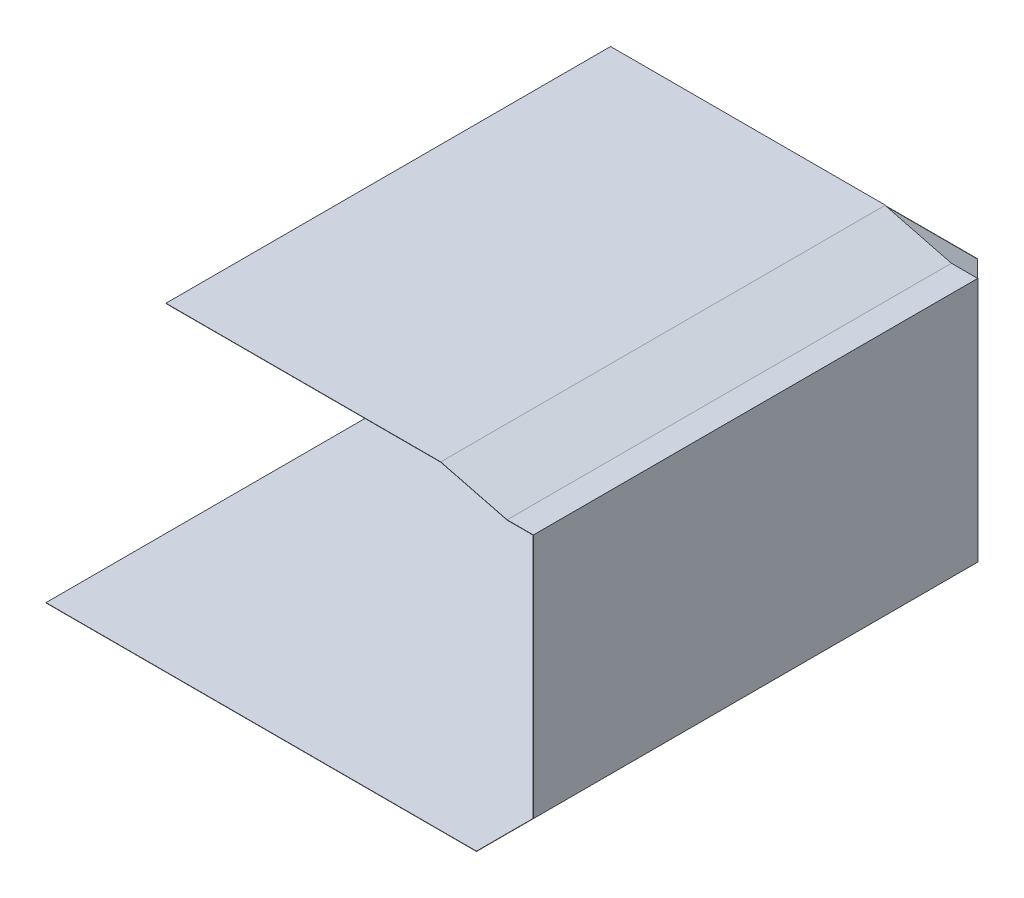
from build123d import *

# Parameters (mm, degrees)
BOSS_EXTRUDE1_DEPTH = 3657.6
SKETCH2_W           = 2.54
SKETCH2_H           = 3657.6
BOSS_EXTRUDE2_DEPTH = 2016.125
SKETCH3_W           = 3020.06
SKETCH3_H           = 2.54
BOSS_EXTRUDE3_DEPTH = 2155.825
SKETCH4_W           = 3541.413977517
SKETCH4_H           = 4125.589628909
BOSS_EXTRUDE4_DEPTH = 2.54


with BuildPart() as part:
    # Sketch1 → Boss-Extrude1 (new body)
    with BuildSketch(Plane.XY):
        Polygon((-2477.647590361, 172.329819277), (-217.047590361, 172.329819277), (329.052409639, 32.629819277), (544.952409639, 32.629819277), (544.952409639, 30.089819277), (328.732673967, 30.089819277), (-217.367326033, 169.789819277), (-2477.647590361, 169.789819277), align=None)
    extrude(amount=BOSS_EXTRUDE1_DEPTH)

    # Sketch2 → Boss-Extrude2 (add)
    with BuildSketch(Plane.XZ.offset(-30.089819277)):
        with Locations((543.682409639, 1828.8)):
            Rectangle(SKETCH2_W, SKETCH2_H)
    extrude(amount=BOSS_EXTRUDE2_DEPTH)

    # Sketch3 → Boss-Extrude3 (add)
    with BuildSketch(Plane.XZ.offset(1986.035180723)):
        with Locations((-967.617590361, 1.27)):
            Rectangle(SKETCH3_W, SKETCH3_H)
    extrude(amount=-BOSS_EXTRUDE3_DEPTH)

    # Sketch4 → Boss-Extrude4 (add)
    with BuildSketch(Plane.XZ.offset(1986.035180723)):
        with Locations((-1225.75457912, 2062.794814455)):
            Rectangle(SKETCH4_W, SKETCH4_H)
    extrude(amount=BOSS_EXTRUDE4_DEPTH)


solid = part.part
